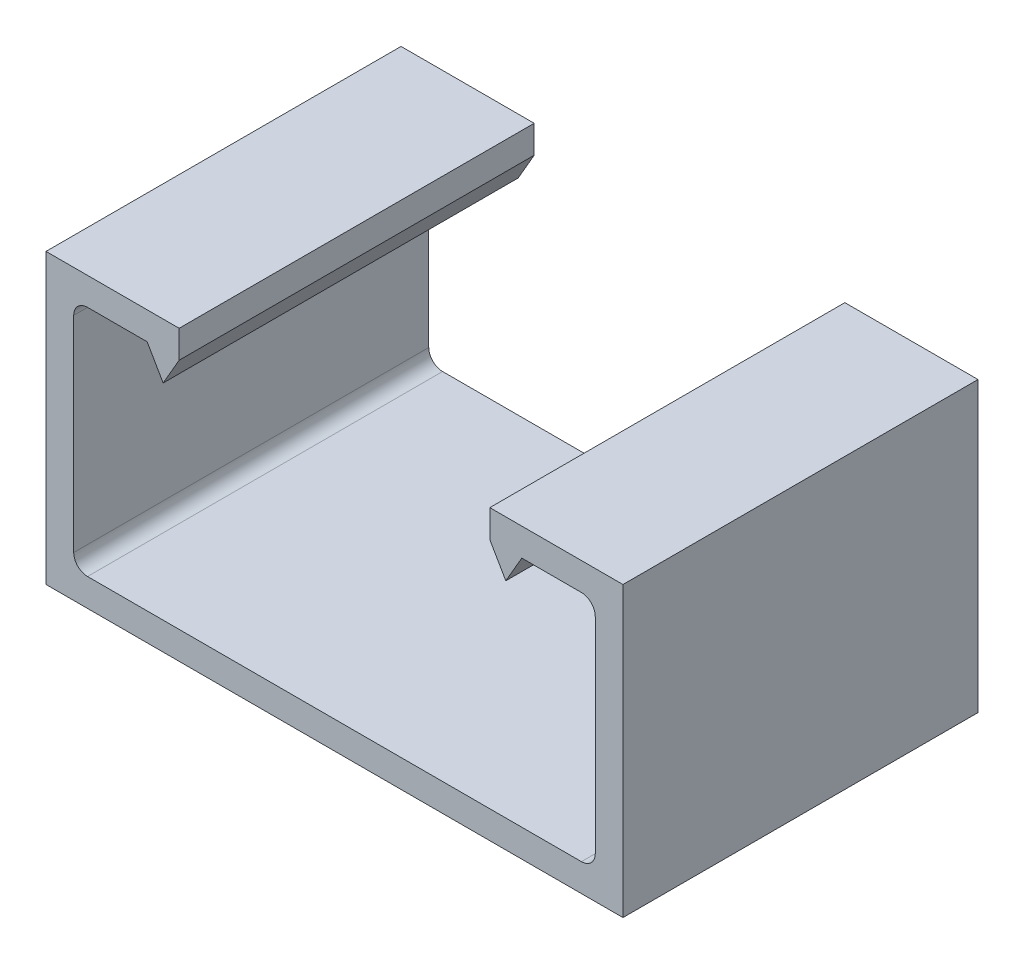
ISO-10303-21;
HEADER;
FILE_DESCRIPTION(('STEP AP214'),'2;1');
FILE_NAME('part.step','',(''),(''),'','','');
FILE_SCHEMA(('AUTOMOTIVE_DESIGN { 1 0 10303 214 1 1 1 1 }'));
ENDSEC;
DATA;
#1=APPLICATION_CONTEXT('core data for automotive mechanical design processes');
#2=APPLICATION_PROTOCOL_DEFINITION('international standard','automotive_design',2000,#1);
#3=PRODUCT_CONTEXT('',#1,'mechanical');
#4=PRODUCT('Part','Part','',(#3));
#5=PRODUCT_RELATED_PRODUCT_CATEGORY('part','',(#4));
#6=PRODUCT_DEFINITION_FORMATION('','',#4);
#7=PRODUCT_DEFINITION_CONTEXT('part definition',#1,'design');
#8=PRODUCT_DEFINITION('design','',#6,#7);
#9=PRODUCT_DEFINITION_SHAPE('','',#8);
#10=(LENGTH_UNIT() NAMED_UNIT(*) SI_UNIT(.MILLI.,.METRE.));
#11=(NAMED_UNIT(*) PLANE_ANGLE_UNIT() SI_UNIT($,.RADIAN.));
#12=(NAMED_UNIT(*) SI_UNIT($,.STERADIAN.) SOLID_ANGLE_UNIT());
#13=UNCERTAINTY_MEASURE_WITH_UNIT(LENGTH_MEASURE(1.E-05),#10,'distance_accuracy_value','');
#14=(GEOMETRIC_REPRESENTATION_CONTEXT(3) GLOBAL_UNCERTAINTY_ASSIGNED_CONTEXT((#13)) GLOBAL_UNIT_ASSIGNED_CONTEXT((#10,
#11,#12)) REPRESENTATION_CONTEXT('',''));
#15=CARTESIAN_POINT('',(0.,0.,0.));
#16=DIRECTION('',(0.,0.,1.));
#17=DIRECTION('',(1.,0.,0.));
#18=AXIS2_PLACEMENT_3D('',#15,#16,#17);
#19=CARTESIAN_POINT('',(-17.6657,-7.34695,12.7));
#20=DIRECTION('',(0.,0.,-1.));
#21=DIRECTION('',(-1.,0.,0.));
#22=AXIS2_PLACEMENT_3D('',#19,#20,#21);
#23=CYLINDRICAL_SURFACE('',#22,0.9906);
#24=CARTESIAN_POINT('',(-17.6657,-7.34695,-12.7));
#25=DIRECTION('',(0.,0.,-1.));
#26=DIRECTION('',(1.,0.,0.));
#27=AXIS2_PLACEMENT_3D('',#24,#25,#26);
#28=CIRCLE('',#27,0.9906);
#29=CARTESIAN_POINT('',(-17.6657,-8.33755,-12.7));
#30=VERTEX_POINT('',#29);
#31=CARTESIAN_POINT('',(-18.6563,-7.34695,-12.7));
#32=VERTEX_POINT('',#31);
#33=EDGE_CURVE('E200',#30,#32,#28,.T.);
#34=ORIENTED_EDGE('',*,*,#33,.T.);
#35=DIRECTION('',(0.,0.,-1.));
#36=VECTOR('',#35,1.);
#37=CARTESIAN_POINT('',(-18.6563,-7.34695,12.7));
#38=LINE('',#37,#36);
#39=CARTESIAN_POINT('',(-18.6563,-7.34695,12.7));
#40=VERTEX_POINT('',#39);
#41=EDGE_CURVE('E11',#40,#32,#38,.T.);
#42=ORIENTED_EDGE('',*,*,#41,.F.);
#43=CARTESIAN_POINT('',(-17.6657,-7.34695,12.7));
#44=DIRECTION('',(0.,0.,-1.));
#45=DIRECTION('',(1.,0.,0.));
#46=AXIS2_PLACEMENT_3D('',#43,#44,#45);
#47=CIRCLE('',#46,0.9906);
#48=CARTESIAN_POINT('',(-17.6657,-8.33755,12.7));
#49=VERTEX_POINT('',#48);
#50=EDGE_CURVE('E238',#49,#40,#47,.T.);
#51=ORIENTED_EDGE('',*,*,#50,.F.);
#52=DIRECTION('',(0.,0.,-1.));
#53=VECTOR('',#52,1.);
#54=CARTESIAN_POINT('',(-17.6657,-8.33755,12.7));
#55=LINE('',#54,#53);
#56=EDGE_CURVE('E196',#49,#30,#55,.T.);
#57=ORIENTED_EDGE('',*,*,#56,.T.);
#58=EDGE_LOOP('',(#34,#42,#51,#57));
#59=FACE_BOUND('',#58,.T.);
#60=ADVANCED_FACE('F32',(#59),#23,.F.);
#61=CARTESIAN_POINT('',(-18.6563,7.34695,12.7));
#62=DIRECTION('',(-1.,0.,0.));
#63=DIRECTION('',(0.,-1.,0.));
#64=AXIS2_PLACEMENT_3D('',#61,#62,#63);
#65=PLANE('',#64);
#66=DIRECTION('',(0.,1.,0.));
#67=VECTOR('',#66,1.);
#68=CARTESIAN_POINT('',(-18.6563,7.34695,-12.7));
#69=LINE('',#68,#67);
#70=CARTESIAN_POINT('',(-18.6563,7.34695,-12.7));
#71=VERTEX_POINT('',#70);
#72=EDGE_CURVE('E203',#32,#71,#69,.T.);
#73=ORIENTED_EDGE('',*,*,#72,.T.);
#74=DIRECTION('',(0.,0.,-1.));
#75=VECTOR('',#74,1.);
#76=CARTESIAN_POINT('',(-18.6563,7.34695,12.7));
#77=LINE('',#76,#75);
#78=CARTESIAN_POINT('',(-18.6563,7.34695,12.7));
#79=VERTEX_POINT('',#78);
#80=EDGE_CURVE('E40',#79,#71,#77,.T.);
#81=ORIENTED_EDGE('',*,*,#80,.F.);
#82=DIRECTION('',(0.,1.,0.));
#83=VECTOR('',#82,1.);
#84=CARTESIAN_POINT('',(-18.6563,7.34695,12.7));
#85=LINE('',#84,#83);
#86=EDGE_CURVE('E127',#40,#79,#85,.T.);
#87=ORIENTED_EDGE('',*,*,#86,.F.);
#88=ORIENTED_EDGE('',*,*,#41,.T.);
#89=EDGE_LOOP('',(#73,#81,#87,#88));
#90=FACE_BOUND('',#89,.T.);
#91=ADVANCED_FACE('F356',(#90),#65,.F.);
#92=CARTESIAN_POINT('',(-17.6657,7.34695,12.7));
#93=DIRECTION('',(0.,0.,-1.));
#94=DIRECTION('',(-1.,0.,0.));
#95=AXIS2_PLACEMENT_3D('',#92,#93,#94);
#96=CYLINDRICAL_SURFACE('',#95,0.990599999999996);
#97=CARTESIAN_POINT('',(-17.6657,7.34695,-12.7));
#98=DIRECTION('',(0.,0.,-1.));
#99=DIRECTION('',(1.,0.,0.));
#100=AXIS2_PLACEMENT_3D('',#97,#98,#99);
#101=CIRCLE('',#100,0.990599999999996);
#102=CARTESIAN_POINT('',(-17.6657,8.33754999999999,-12.7));
#103=VERTEX_POINT('',#102);
#104=EDGE_CURVE('E205',#71,#103,#101,.T.);
#105=ORIENTED_EDGE('',*,*,#104,.T.);
#106=DIRECTION('',(0.,0.,-1.));
#107=VECTOR('',#106,1.);
#108=CARTESIAN_POINT('',(-17.6657,8.33754999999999,12.7));
#109=LINE('',#108,#107);
#110=CARTESIAN_POINT('',(-17.6657,8.33754999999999,12.7));
#111=VERTEX_POINT('',#110);
#112=EDGE_CURVE('E281',#111,#103,#109,.T.);
#113=ORIENTED_EDGE('',*,*,#112,.F.);
#114=CARTESIAN_POINT('',(-17.6657,7.34695,12.7));
#115=DIRECTION('',(0.,0.,-1.));
#116=DIRECTION('',(1.,0.,0.));
#117=AXIS2_PLACEMENT_3D('',#114,#115,#116);
#118=CIRCLE('',#117,0.990599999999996);
#119=EDGE_CURVE('E289',#79,#111,#118,.T.);
#120=ORIENTED_EDGE('',*,*,#119,.F.);
#121=ORIENTED_EDGE('',*,*,#80,.T.);
#122=EDGE_LOOP('',(#105,#113,#120,#121));
#123=FACE_BOUND('',#122,.T.);
#124=ADVANCED_FACE('F287',(#123),#96,.F.);
#125=CARTESIAN_POINT('',(-13.400192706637,8.33755,12.7));
#126=DIRECTION('',(0.,1.,0.));
#127=DIRECTION('',(-1.,0.,0.));
#128=AXIS2_PLACEMENT_3D('',#125,#126,#127);
#129=PLANE('',#128);
#130=DIRECTION('',(1.,0.,0.));
#131=VECTOR('',#130,1.);
#132=CARTESIAN_POINT('',(-13.400192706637,8.33755,-12.7));
#133=LINE('',#132,#131);
#134=CARTESIAN_POINT('',(-13.400192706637,8.33755,-12.7));
#135=VERTEX_POINT('',#134);
#136=EDGE_CURVE('E207',#103,#135,#133,.T.);
#137=ORIENTED_EDGE('',*,*,#136,.T.);
#138=DIRECTION('',(0.,0.,-1.));
#139=VECTOR('',#138,1.);
#140=CARTESIAN_POINT('',(-13.400192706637,8.33755,12.7));
#141=LINE('',#140,#139);
#142=CARTESIAN_POINT('',(-13.400192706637,8.33755,12.7));
#143=VERTEX_POINT('',#142);
#144=EDGE_CURVE('E278',#143,#135,#141,.T.);
#145=ORIENTED_EDGE('',*,*,#144,.F.);
#146=DIRECTION('',(1.,0.,0.));
#147=VECTOR('',#146,1.);
#148=CARTESIAN_POINT('',(-13.400192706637,8.33755,12.7));
#149=LINE('',#148,#147);
#150=EDGE_CURVE('E307',#111,#143,#149,.T.);
#151=ORIENTED_EDGE('',*,*,#150,.F.);
#152=ORIENTED_EDGE('',*,*,#112,.T.);
#153=EDGE_LOOP('',(#137,#145,#151,#152));
#154=FACE_BOUND('',#153,.T.);
#155=ADVANCED_FACE('F298',(#154),#129,.F.);
#156=CARTESIAN_POINT('',(-13.400192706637,8.33755,12.7));
#157=DIRECTION('',(0.866025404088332,0.499999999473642,0.));
#158=DIRECTION('',(-0.499999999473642,0.866025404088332,0.));
#159=AXIS2_PLACEMENT_3D('',#156,#157,#158);
#160=PLANE('',#159);
#161=DIRECTION('',(0.499999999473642,-0.866025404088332,0.));
#162=VECTOR('',#161,1.);
#163=CARTESIAN_POINT('',(-13.400192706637,8.33755,-12.7));
#164=LINE('',#163,#162);
#165=CARTESIAN_POINT('',(-12.256346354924,6.35635,-12.7));
#166=VERTEX_POINT('',#165);
#167=EDGE_CURVE('E209',#135,#166,#164,.T.);
#168=ORIENTED_EDGE('',*,*,#167,.T.);
#169=DIRECTION('',(0.,0.,-1.));
#170=VECTOR('',#169,1.);
#171=CARTESIAN_POINT('',(-12.256346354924,6.35635,12.7));
#172=LINE('',#171,#170);
#173=CARTESIAN_POINT('',(-12.256346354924,6.35635,12.7));
#174=VERTEX_POINT('',#173);
#175=EDGE_CURVE('E275',#174,#166,#172,.T.);
#176=ORIENTED_EDGE('',*,*,#175,.F.);
#177=DIRECTION('',(0.499999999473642,-0.866025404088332,0.));
#178=VECTOR('',#177,1.);
#179=CARTESIAN_POINT('',(-13.400192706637,8.33755,12.7));
#180=LINE('',#179,#178);
#181=EDGE_CURVE('E304',#143,#174,#180,.T.);
#182=ORIENTED_EDGE('',*,*,#181,.F.);
#183=ORIENTED_EDGE('',*,*,#144,.T.);
#184=EDGE_LOOP('',(#168,#176,#182,#183));
#185=FACE_BOUND('',#184,.T.);
#186=ADVANCED_FACE('F302',(#185),#160,.F.);
#187=CARTESIAN_POINT('',(-12.256346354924,6.35635,12.7));
#188=DIRECTION('',(-0.866025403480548,0.500000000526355,0.));
#189=DIRECTION('',(-0.500000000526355,-0.866025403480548,0.));
#190=AXIS2_PLACEMENT_3D('',#187,#188,#189);
#191=PLANE('',#190);
#192=DIRECTION('',(0.500000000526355,0.866025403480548,0.));
#193=VECTOR('',#192,1.);
#194=CARTESIAN_POINT('',(-12.256346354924,6.35635,-12.7));
#195=LINE('',#194,#193);
#196=CARTESIAN_POINT('',(-11.1125,8.33755,-12.7));
#197=VERTEX_POINT('',#196);
#198=EDGE_CURVE('E211',#166,#197,#195,.T.);
#199=ORIENTED_EDGE('',*,*,#198,.T.);
#200=DIRECTION('',(0.,0.,-1.));
#201=VECTOR('',#200,1.);
#202=CARTESIAN_POINT('',(-11.1125,8.33755,12.7));
#203=LINE('',#202,#201);
#204=CARTESIAN_POINT('',(-11.1125,8.33755,12.7));
#205=VERTEX_POINT('',#204);
#206=EDGE_CURVE('E272',#205,#197,#203,.T.);
#207=ORIENTED_EDGE('',*,*,#206,.F.);
#208=DIRECTION('',(0.500000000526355,0.866025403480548,0.));
#209=VECTOR('',#208,1.);
#210=CARTESIAN_POINT('',(-12.256346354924,6.35635,12.7));
#211=LINE('',#210,#209);
#212=EDGE_CURVE('E306',#174,#205,#211,.T.);
#213=ORIENTED_EDGE('',*,*,#212,.F.);
#214=ORIENTED_EDGE('',*,*,#175,.T.);
#215=EDGE_LOOP('',(#199,#207,#213,#214));
#216=FACE_BOUND('',#215,.T.);
#217=ADVANCED_FACE('F369',(#216),#191,.F.);
#218=CARTESIAN_POINT('',(-11.1125,8.33755,12.7));
#219=DIRECTION('',(-1.,0.,0.));
#220=DIRECTION('',(0.,-1.,0.));
#221=AXIS2_PLACEMENT_3D('',#218,#219,#220);
#222=PLANE('',#221);
#223=DIRECTION('',(0.,1.,0.));
#224=VECTOR('',#223,1.);
#225=CARTESIAN_POINT('',(-11.1125,8.33755,-12.7));
#226=LINE('',#225,#224);
#227=CARTESIAN_POINT('',(-11.1125,10.31875,-12.7));
#228=VERTEX_POINT('',#227);
#229=EDGE_CURVE('E213',#197,#228,#226,.T.);
#230=ORIENTED_EDGE('',*,*,#229,.T.);
#231=DIRECTION('',(0.,0.,-1.));
#232=VECTOR('',#231,1.);
#233=CARTESIAN_POINT('',(-11.1125,10.31875,12.7));
#234=LINE('',#233,#232);
#235=CARTESIAN_POINT('',(-11.1125,10.31875,12.7));
#236=VERTEX_POINT('',#235);
#237=EDGE_CURVE('E269',#236,#228,#234,.T.);
#238=ORIENTED_EDGE('',*,*,#237,.F.);
#239=DIRECTION('',(0.,1.,0.));
#240=VECTOR('',#239,1.);
#241=CARTESIAN_POINT('',(-11.1125,8.33755,12.7));
#242=LINE('',#241,#240);
#243=EDGE_CURVE('E309',#205,#236,#242,.T.);
#244=ORIENTED_EDGE('',*,*,#243,.F.);
#245=ORIENTED_EDGE('',*,*,#206,.T.);
#246=EDGE_LOOP('',(#230,#238,#244,#245));
#247=FACE_BOUND('',#246,.T.);
#248=ADVANCED_FACE('F372',(#247),#222,.F.);
#249=CARTESIAN_POINT('',(-11.1125,10.31875,12.7));
#250=DIRECTION('',(0.,-1.,0.));
#251=DIRECTION('',(1.,0.,0.));
#252=AXIS2_PLACEMENT_3D('',#249,#250,#251);
#253=PLANE('',#252);
#254=DIRECTION('',(-1.,0.,0.));
#255=VECTOR('',#254,1.);
#256=CARTESIAN_POINT('',(-11.1125,10.31875,-12.7));
#257=LINE('',#256,#255);
#258=CARTESIAN_POINT('',(-20.6375,10.31875,-12.7));
#259=VERTEX_POINT('',#258);
#260=EDGE_CURVE('E215',#228,#259,#257,.T.);
#261=ORIENTED_EDGE('',*,*,#260,.T.);
#262=DIRECTION('',(0.,0.,-1.));
#263=VECTOR('',#262,1.);
#264=CARTESIAN_POINT('',(-20.6375,10.31875,12.7));
#265=LINE('',#264,#263);
#266=CARTESIAN_POINT('',(-20.6375,10.31875,12.7));
#267=VERTEX_POINT('',#266);
#268=EDGE_CURVE('E266',#267,#259,#265,.T.);
#269=ORIENTED_EDGE('',*,*,#268,.F.);
#270=DIRECTION('',(-1.,0.,0.));
#271=VECTOR('',#270,1.);
#272=CARTESIAN_POINT('',(-11.1125,10.31875,12.7));
#273=LINE('',#272,#271);
#274=EDGE_CURVE('E315',#236,#267,#273,.T.);
#275=ORIENTED_EDGE('',*,*,#274,.F.);
#276=ORIENTED_EDGE('',*,*,#237,.T.);
#277=EDGE_LOOP('',(#261,#269,#275,#276));
#278=FACE_BOUND('',#277,.T.);
#279=ADVANCED_FACE('F376',(#278),#253,.F.);
#280=CARTESIAN_POINT('',(-20.6375,10.31875,12.7));
#281=DIRECTION('',(1.,0.,0.));
#282=DIRECTION('',(0.,1.,0.));
#283=AXIS2_PLACEMENT_3D('',#280,#281,#282);
#284=PLANE('',#283);
#285=DIRECTION('',(0.,-1.,0.));
#286=VECTOR('',#285,1.);
#287=CARTESIAN_POINT('',(-20.6375,10.31875,-12.7));
#288=LINE('',#287,#286);
#289=CARTESIAN_POINT('',(-20.6375,-10.31875,-12.7));
#290=VERTEX_POINT('',#289);
#291=EDGE_CURVE('E217',#259,#290,#288,.T.);
#292=ORIENTED_EDGE('',*,*,#291,.T.);
#293=DIRECTION('',(0.,0.,-1.));
#294=VECTOR('',#293,1.);
#295=CARTESIAN_POINT('',(-20.6375,-10.31875,12.7));
#296=LINE('',#295,#294);
#297=CARTESIAN_POINT('',(-20.6375,-10.31875,12.7));
#298=VERTEX_POINT('',#297);
#299=EDGE_CURVE('E263',#298,#290,#296,.T.);
#300=ORIENTED_EDGE('',*,*,#299,.F.);
#301=DIRECTION('',(0.,-1.,0.));
#302=VECTOR('',#301,1.);
#303=CARTESIAN_POINT('',(-20.6375,10.31875,12.7));
#304=LINE('',#303,#302);
#305=EDGE_CURVE('E317',#267,#298,#304,.T.);
#306=ORIENTED_EDGE('',*,*,#305,.F.);
#307=ORIENTED_EDGE('',*,*,#268,.T.);
#308=EDGE_LOOP('',(#292,#300,#306,#307));
#309=FACE_BOUND('',#308,.T.);
#310=ADVANCED_FACE('F380',(#309),#284,.F.);
#311=CARTESIAN_POINT('',(-20.6375,-10.31875,12.7));
#312=DIRECTION('',(0.,1.,0.));
#313=DIRECTION('',(0.,0.,1.));
#314=AXIS2_PLACEMENT_3D('',#311,#312,#313);
#315=PLANE('',#314);
#316=DIRECTION('',(1.,0.,0.));
#317=VECTOR('',#316,1.);
#318=CARTESIAN_POINT('',(-20.6375,-10.31875,-12.7));
#319=LINE('',#318,#317);
#320=CARTESIAN_POINT('',(20.6375,-10.31875,-12.7));
#321=VERTEX_POINT('',#320);
#322=EDGE_CURVE('E219',#290,#321,#319,.T.);
#323=ORIENTED_EDGE('',*,*,#322,.T.);
#324=DIRECTION('',(0.,0.,-1.));
#325=VECTOR('',#324,1.);
#326=CARTESIAN_POINT('',(20.6375,-10.31875,12.7));
#327=LINE('',#326,#325);
#328=CARTESIAN_POINT('',(20.6375,-10.31875,12.7));
#329=VERTEX_POINT('',#328);
#330=EDGE_CURVE('E260',#329,#321,#327,.T.);
#331=ORIENTED_EDGE('',*,*,#330,.F.);
#332=DIRECTION('',(1.,0.,0.));
#333=VECTOR('',#332,1.);
#334=CARTESIAN_POINT('',(-20.6375,-10.31875,12.7));
#335=LINE('',#334,#333);
#336=EDGE_CURVE('E319',#298,#329,#335,.T.);
#337=ORIENTED_EDGE('',*,*,#336,.F.);
#338=ORIENTED_EDGE('',*,*,#299,.T.);
#339=EDGE_LOOP('',(#323,#331,#337,#338));
#340=FACE_BOUND('',#339,.T.);
#341=ADVANCED_FACE('F384',(#340),#315,.F.);
#342=CARTESIAN_POINT('',(20.6375,-10.31875,12.7));
#343=DIRECTION('',(-1.,0.,0.));
#344=DIRECTION('',(0.,0.,1.));
#345=AXIS2_PLACEMENT_3D('',#342,#343,#344);
#346=PLANE('',#345);
#347=DIRECTION('',(0.,1.,0.));
#348=VECTOR('',#347,1.);
#349=CARTESIAN_POINT('',(20.6375,-10.31875,-12.7));
#350=LINE('',#349,#348);
#351=CARTESIAN_POINT('',(20.6375,10.31875,-12.7));
#352=VERTEX_POINT('',#351);
#353=EDGE_CURVE('E221',#321,#352,#350,.T.);
#354=ORIENTED_EDGE('',*,*,#353,.T.);
#355=DIRECTION('',(0.,0.,-1.));
#356=VECTOR('',#355,1.);
#357=CARTESIAN_POINT('',(20.6375,10.31875,12.7));
#358=LINE('',#357,#356);
#359=CARTESIAN_POINT('',(20.6375,10.31875,12.7));
#360=VERTEX_POINT('',#359);
#361=EDGE_CURVE('E257',#360,#352,#358,.T.);
#362=ORIENTED_EDGE('',*,*,#361,.F.);
#363=DIRECTION('',(0.,1.,0.));
#364=VECTOR('',#363,1.);
#365=CARTESIAN_POINT('',(20.6375,-10.31875,12.7));
#366=LINE('',#365,#364);
#367=EDGE_CURVE('E321',#329,#360,#366,.T.);
#368=ORIENTED_EDGE('',*,*,#367,.F.);
#369=ORIENTED_EDGE('',*,*,#330,.T.);
#370=EDGE_LOOP('',(#354,#362,#368,#369));
#371=FACE_BOUND('',#370,.T.);
#372=ADVANCED_FACE('F388',(#371),#346,.F.);
#373=CARTESIAN_POINT('',(20.6375,10.31875,12.7));
#374=DIRECTION('',(0.,-1.,0.));
#375=DIRECTION('',(0.,0.,-1.));
#376=AXIS2_PLACEMENT_3D('',#373,#374,#375);
#377=PLANE('',#376);
#378=DIRECTION('',(-1.,0.,0.));
#379=VECTOR('',#378,1.);
#380=CARTESIAN_POINT('',(20.6375,10.31875,-12.7));
#381=LINE('',#380,#379);
#382=CARTESIAN_POINT('',(11.1125,10.31875,-12.7));
#383=VERTEX_POINT('',#382);
#384=EDGE_CURVE('E223',#352,#383,#381,.T.);
#385=ORIENTED_EDGE('',*,*,#384,.T.);
#386=DIRECTION('',(0.,0.,-1.));
#387=VECTOR('',#386,1.);
#388=CARTESIAN_POINT('',(11.1125,10.31875,12.7));
#389=LINE('',#388,#387);
#390=CARTESIAN_POINT('',(11.1125,10.31875,12.7));
#391=VERTEX_POINT('',#390);
#392=EDGE_CURVE('E254',#391,#383,#389,.T.);
#393=ORIENTED_EDGE('',*,*,#392,.F.);
#394=DIRECTION('',(-1.,0.,0.));
#395=VECTOR('',#394,1.);
#396=CARTESIAN_POINT('',(20.6375,10.31875,12.7));
#397=LINE('',#396,#395);
#398=EDGE_CURVE('E323',#360,#391,#397,.T.);
#399=ORIENTED_EDGE('',*,*,#398,.F.);
#400=ORIENTED_EDGE('',*,*,#361,.T.);
#401=EDGE_LOOP('',(#385,#393,#399,#400));
#402=FACE_BOUND('',#401,.T.);
#403=ADVANCED_FACE('F392',(#402),#377,.F.);
#404=CARTESIAN_POINT('',(11.1125,8.33755,12.7));
#405=DIRECTION('',(1.,0.,0.));
#406=DIRECTION('',(0.,1.,0.));
#407=AXIS2_PLACEMENT_3D('',#404,#405,#406);
#408=PLANE('',#407);
#409=DIRECTION('',(0.,-1.,0.));
#410=VECTOR('',#409,1.);
#411=CARTESIAN_POINT('',(11.1125,8.33755,-12.7));
#412=LINE('',#411,#410);
#413=CARTESIAN_POINT('',(11.1125,8.33755,-12.7));
#414=VERTEX_POINT('',#413);
#415=EDGE_CURVE('E225',#383,#414,#412,.T.);
#416=ORIENTED_EDGE('',*,*,#415,.T.);
#417=DIRECTION('',(0.,0.,-1.));
#418=VECTOR('',#417,1.);
#419=CARTESIAN_POINT('',(11.1125,8.33755,12.7));
#420=LINE('',#419,#418);
#421=CARTESIAN_POINT('',(11.1125,8.33755,12.7));
#422=VERTEX_POINT('',#421);
#423=EDGE_CURVE('E251',#422,#414,#420,.T.);
#424=ORIENTED_EDGE('',*,*,#423,.F.);
#425=DIRECTION('',(0.,-1.,0.));
#426=VECTOR('',#425,1.);
#427=CARTESIAN_POINT('',(11.1125,8.33755,12.7));
#428=LINE('',#427,#426);
#429=EDGE_CURVE('E325',#391,#422,#428,.T.);
#430=ORIENTED_EDGE('',*,*,#429,.F.);
#431=ORIENTED_EDGE('',*,*,#392,.T.);
#432=EDGE_LOOP('',(#416,#424,#430,#431));
#433=FACE_BOUND('',#432,.T.);
#434=ADVANCED_FACE('F396',(#433),#408,.F.);
#435=CARTESIAN_POINT('',(12.256346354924,6.35635,12.7));
#436=DIRECTION('',(0.866025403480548,0.500000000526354,0.));
#437=DIRECTION('',(-0.500000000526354,0.866025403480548,0.));
#438=AXIS2_PLACEMENT_3D('',#435,#436,#437);
#439=PLANE('',#438);
#440=DIRECTION('',(0.500000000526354,-0.866025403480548,0.));
#441=VECTOR('',#440,1.);
#442=CARTESIAN_POINT('',(12.256346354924,6.35635,-12.7));
#443=LINE('',#442,#441);
#444=CARTESIAN_POINT('',(12.256346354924,6.35635,-12.7));
#445=VERTEX_POINT('',#444);
#446=EDGE_CURVE('E227',#414,#445,#443,.T.);
#447=ORIENTED_EDGE('',*,*,#446,.T.);
#448=DIRECTION('',(0.,0.,-1.));
#449=VECTOR('',#448,1.);
#450=CARTESIAN_POINT('',(12.256346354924,6.35635,12.7));
#451=LINE('',#450,#449);
#452=CARTESIAN_POINT('',(12.256346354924,6.35635,12.7));
#453=VERTEX_POINT('',#452);
#454=EDGE_CURVE('E248',#453,#445,#451,.T.);
#455=ORIENTED_EDGE('',*,*,#454,.F.);
#456=DIRECTION('',(0.500000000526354,-0.866025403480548,0.));
#457=VECTOR('',#456,1.);
#458=CARTESIAN_POINT('',(12.256346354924,6.35635,12.7));
#459=LINE('',#458,#457);
#460=EDGE_CURVE('E327',#422,#453,#459,.T.);
#461=ORIENTED_EDGE('',*,*,#460,.F.);
#462=ORIENTED_EDGE('',*,*,#423,.T.);
#463=EDGE_LOOP('',(#447,#455,#461,#462));
#464=FACE_BOUND('',#463,.T.);
#465=ADVANCED_FACE('F400',(#464),#439,.F.);
#466=CARTESIAN_POINT('',(13.400192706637,8.33755,12.7));
#467=DIRECTION('',(-0.866025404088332,0.499999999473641,0.));
#468=DIRECTION('',(-0.499999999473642,-0.866025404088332,0.));
#469=AXIS2_PLACEMENT_3D('',#466,#467,#468);
#470=PLANE('',#469);
#471=DIRECTION('',(0.499999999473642,0.866025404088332,0.));
#472=VECTOR('',#471,1.);
#473=CARTESIAN_POINT('',(13.400192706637,8.33755,-12.7));
#474=LINE('',#473,#472);
#475=CARTESIAN_POINT('',(13.400192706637,8.33755,-12.7));
#476=VERTEX_POINT('',#475);
#477=EDGE_CURVE('E229',#445,#476,#474,.T.);
#478=ORIENTED_EDGE('',*,*,#477,.T.);
#479=DIRECTION('',(0.,0.,-1.));
#480=VECTOR('',#479,1.);
#481=CARTESIAN_POINT('',(13.400192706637,8.33755,12.7));
#482=LINE('',#481,#480);
#483=CARTESIAN_POINT('',(13.400192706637,8.33755,12.7));
#484=VERTEX_POINT('',#483);
#485=EDGE_CURVE('E245',#484,#476,#482,.T.);
#486=ORIENTED_EDGE('',*,*,#485,.F.);
#487=DIRECTION('',(0.499999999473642,0.866025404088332,0.));
#488=VECTOR('',#487,1.);
#489=CARTESIAN_POINT('',(13.400192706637,8.33755,12.7));
#490=LINE('',#489,#488);
#491=EDGE_CURVE('E329',#453,#484,#490,.T.);
#492=ORIENTED_EDGE('',*,*,#491,.F.);
#493=ORIENTED_EDGE('',*,*,#454,.T.);
#494=EDGE_LOOP('',(#478,#486,#492,#493));
#495=FACE_BOUND('',#494,.T.);
#496=ADVANCED_FACE('F404',(#495),#470,.F.);
#497=CARTESIAN_POINT('',(17.6657,8.33755,12.7));
#498=DIRECTION('',(0.,1.,0.));
#499=DIRECTION('',(-1.,0.,0.));
#500=AXIS2_PLACEMENT_3D('',#497,#498,#499);
#501=PLANE('',#500);
#502=DIRECTION('',(1.,0.,0.));
#503=VECTOR('',#502,1.);
#504=CARTESIAN_POINT('',(17.6657,8.33755,-12.7));
#505=LINE('',#504,#503);
#506=CARTESIAN_POINT('',(17.6657,8.33755,-12.7));
#507=VERTEX_POINT('',#506);
#508=EDGE_CURVE('E231',#476,#507,#505,.T.);
#509=ORIENTED_EDGE('',*,*,#508,.T.);
#510=DIRECTION('',(0.,0.,-1.));
#511=VECTOR('',#510,1.);
#512=CARTESIAN_POINT('',(17.6657,8.33755,12.7));
#513=LINE('',#512,#511);
#514=CARTESIAN_POINT('',(17.6657,8.33755,12.7));
#515=VERTEX_POINT('',#514);
#516=EDGE_CURVE('E242',#515,#507,#513,.T.);
#517=ORIENTED_EDGE('',*,*,#516,.F.);
#518=DIRECTION('',(1.,0.,0.));
#519=VECTOR('',#518,1.);
#520=CARTESIAN_POINT('',(17.6657,8.33755,12.7));
#521=LINE('',#520,#519);
#522=EDGE_CURVE('E331',#484,#515,#521,.T.);
#523=ORIENTED_EDGE('',*,*,#522,.F.);
#524=ORIENTED_EDGE('',*,*,#485,.T.);
#525=EDGE_LOOP('',(#509,#517,#523,#524));
#526=FACE_BOUND('',#525,.T.);
#527=ADVANCED_FACE('F337',(#526),#501,.F.);
#528=CARTESIAN_POINT('',(17.6657,7.34695,12.7));
#529=DIRECTION('',(0.,0.,-1.));
#530=DIRECTION('',(-1.,0.,0.));
#531=AXIS2_PLACEMENT_3D('',#528,#529,#530);
#532=CYLINDRICAL_SURFACE('',#531,0.990599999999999);
#533=CARTESIAN_POINT('',(17.6657,7.34695,-12.7));
#534=DIRECTION('',(0.,0.,-1.));
#535=DIRECTION('',(1.,0.,0.));
#536=AXIS2_PLACEMENT_3D('',#533,#534,#535);
#537=CIRCLE('',#536,0.990599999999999);
#538=CARTESIAN_POINT('',(18.6563,7.34695,-12.7));
#539=VERTEX_POINT('',#538);
#540=EDGE_CURVE('E233',#507,#539,#537,.T.);
#541=ORIENTED_EDGE('',*,*,#540,.T.);
#542=DIRECTION('',(0.,0.,-1.));
#543=VECTOR('',#542,1.);
#544=CARTESIAN_POINT('',(18.6563,7.34695,12.7));
#545=LINE('',#544,#543);
#546=CARTESIAN_POINT('',(18.6563,7.34695,12.7));
#547=VERTEX_POINT('',#546);
#548=EDGE_CURVE('E191',#547,#539,#545,.T.);
#549=ORIENTED_EDGE('',*,*,#548,.F.);
#550=CARTESIAN_POINT('',(17.6657,7.34695,12.7));
#551=DIRECTION('',(0.,0.,-1.));
#552=DIRECTION('',(1.,0.,0.));
#553=AXIS2_PLACEMENT_3D('',#550,#551,#552);
#554=CIRCLE('',#553,0.990599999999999);
#555=EDGE_CURVE('E182',#515,#547,#554,.T.);
#556=ORIENTED_EDGE('',*,*,#555,.F.);
#557=ORIENTED_EDGE('',*,*,#516,.T.);
#558=EDGE_LOOP('',(#541,#549,#556,#557));
#559=FACE_BOUND('',#558,.T.);
#560=ADVANCED_FACE('F341',(#559),#532,.F.);
#561=CARTESIAN_POINT('',(18.6563,-7.34695,12.7));
#562=DIRECTION('',(1.,0.,0.));
#563=DIRECTION('',(0.,1.,0.));
#564=AXIS2_PLACEMENT_3D('',#561,#562,#563);
#565=PLANE('',#564);
#566=DIRECTION('',(0.,-1.,0.));
#567=VECTOR('',#566,1.);
#568=CARTESIAN_POINT('',(18.6563,-7.34695,-12.7));
#569=LINE('',#568,#567);
#570=CARTESIAN_POINT('',(18.6563,-7.34695,-12.7));
#571=VERTEX_POINT('',#570);
#572=EDGE_CURVE('E190',#539,#571,#569,.T.);
#573=ORIENTED_EDGE('',*,*,#572,.T.);
#574=DIRECTION('',(0.,0.,-1.));
#575=VECTOR('',#574,1.);
#576=CARTESIAN_POINT('',(18.6563,-7.34695,12.7));
#577=LINE('',#576,#575);
#578=CARTESIAN_POINT('',(18.6563,-7.34695,12.7));
#579=VERTEX_POINT('',#578);
#580=EDGE_CURVE('E187',#579,#571,#577,.T.);
#581=ORIENTED_EDGE('',*,*,#580,.F.);
#582=DIRECTION('',(0.,-1.,0.));
#583=VECTOR('',#582,1.);
#584=CARTESIAN_POINT('',(18.6563,-7.34695,12.7));
#585=LINE('',#584,#583);
#586=EDGE_CURVE('E176',#547,#579,#585,.T.);
#587=ORIENTED_EDGE('',*,*,#586,.F.);
#588=ORIENTED_EDGE('',*,*,#548,.T.);
#589=EDGE_LOOP('',(#573,#581,#587,#588));
#590=FACE_BOUND('',#589,.T.);
#591=ADVANCED_FACE('F188',(#590),#565,.F.);
#592=CARTESIAN_POINT('',(17.6657,-7.34695,12.7));
#593=DIRECTION('',(0.,0.,-1.));
#594=DIRECTION('',(-1.,0.,0.));
#595=AXIS2_PLACEMENT_3D('',#592,#593,#594);
#596=CYLINDRICAL_SURFACE('',#595,0.990599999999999);
#597=CARTESIAN_POINT('',(17.6657,-7.34695,-12.7));
#598=DIRECTION('',(0.,0.,-1.));
#599=DIRECTION('',(1.,0.,0.));
#600=AXIS2_PLACEMENT_3D('',#597,#598,#599);
#601=CIRCLE('',#600,0.990599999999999);
#602=CARTESIAN_POINT('',(17.6657,-8.33755,-12.7));
#603=VERTEX_POINT('',#602);
#604=EDGE_CURVE('E113',#571,#603,#601,.T.);
#605=ORIENTED_EDGE('',*,*,#604,.T.);
#606=DIRECTION('',(0.,0.,-1.));
#607=VECTOR('',#606,1.);
#608=CARTESIAN_POINT('',(17.6657,-8.33755,12.7));
#609=LINE('',#608,#607);
#610=CARTESIAN_POINT('',(17.6657,-8.33755,12.7));
#611=VERTEX_POINT('',#610);
#612=EDGE_CURVE('E192',#611,#603,#609,.T.);
#613=ORIENTED_EDGE('',*,*,#612,.F.);
#614=CARTESIAN_POINT('',(17.6657,-7.34695,12.7));
#615=DIRECTION('',(0.,0.,-1.));
#616=DIRECTION('',(1.,0.,0.));
#617=AXIS2_PLACEMENT_3D('',#614,#615,#616);
#618=CIRCLE('',#617,0.990599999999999);
#619=EDGE_CURVE('E180',#579,#611,#618,.T.);
#620=ORIENTED_EDGE('',*,*,#619,.F.);
#621=ORIENTED_EDGE('',*,*,#580,.T.);
#622=EDGE_LOOP('',(#605,#613,#620,#621));
#623=FACE_BOUND('',#622,.T.);
#624=ADVANCED_FACE('F194',(#623),#596,.F.);
#625=CARTESIAN_POINT('',(-17.6657,-8.33755,12.7));
#626=DIRECTION('',(0.,-1.,0.));
#627=DIRECTION('',(0.,0.,-1.));
#628=AXIS2_PLACEMENT_3D('',#625,#626,#627);
#629=PLANE('',#628);
#630=DIRECTION('',(-1.,0.,0.));
#631=VECTOR('',#630,1.);
#632=CARTESIAN_POINT('',(-17.6657,-8.33755,-12.7));
#633=LINE('',#632,#631);
#634=EDGE_CURVE('E119',#603,#30,#633,.T.);
#635=ORIENTED_EDGE('',*,*,#634,.T.);
#636=ORIENTED_EDGE('',*,*,#56,.F.);
#637=DIRECTION('',(-1.,0.,0.));
#638=VECTOR('',#637,1.);
#639=CARTESIAN_POINT('',(-17.6657,-8.33755,12.7));
#640=LINE('',#639,#638);
#641=EDGE_CURVE('E48',#611,#49,#640,.T.);
#642=ORIENTED_EDGE('',*,*,#641,.F.);
#643=ORIENTED_EDGE('',*,*,#612,.T.);
#644=EDGE_LOOP('',(#635,#636,#642,#643));
#645=FACE_BOUND('',#644,.T.);
#646=ADVANCED_FACE('F345',(#645),#629,.F.);
#647=CARTESIAN_POINT('',(-17.6657,-7.34695,12.7));
#648=DIRECTION('',(0.,0.,1.));
#649=DIRECTION('',(1.,0.,0.));
#650=AXIS2_PLACEMENT_3D('',#647,#648,#649);
#651=PLANE('',#650);
#652=ORIENTED_EDGE('',*,*,#50,.T.);
#653=ORIENTED_EDGE('',*,*,#86,.T.);
#654=ORIENTED_EDGE('',*,*,#119,.T.);
#655=ORIENTED_EDGE('',*,*,#150,.T.);
#656=ORIENTED_EDGE('',*,*,#181,.T.);
#657=ORIENTED_EDGE('',*,*,#212,.T.);
#658=ORIENTED_EDGE('',*,*,#243,.T.);
#659=ORIENTED_EDGE('',*,*,#274,.T.);
#660=ORIENTED_EDGE('',*,*,#305,.T.);
#661=ORIENTED_EDGE('',*,*,#336,.T.);
#662=ORIENTED_EDGE('',*,*,#367,.T.);
#663=ORIENTED_EDGE('',*,*,#398,.T.);
#664=ORIENTED_EDGE('',*,*,#429,.T.);
#665=ORIENTED_EDGE('',*,*,#460,.T.);
#666=ORIENTED_EDGE('',*,*,#491,.T.);
#667=ORIENTED_EDGE('',*,*,#522,.T.);
#668=ORIENTED_EDGE('',*,*,#555,.T.);
#669=ORIENTED_EDGE('',*,*,#586,.T.);
#670=ORIENTED_EDGE('',*,*,#619,.T.);
#671=ORIENTED_EDGE('',*,*,#641,.T.);
#672=EDGE_LOOP('',(#652,#653,#654,#655,#656,#657,#658,#659,#660,#661,#662,#663,#664,#665,#666,
#667,#668,#669,#670,#671));
#673=FACE_BOUND('',#672,.T.);
#674=ADVANCED_FACE('F178',(#673),#651,.T.);
#675=CARTESIAN_POINT('',(-17.6657,-7.34695,-12.7));
#676=DIRECTION('',(0.,0.,1.));
#677=DIRECTION('',(1.,0.,0.));
#678=AXIS2_PLACEMENT_3D('',#675,#676,#677);
#679=PLANE('',#678);
#680=ORIENTED_EDGE('',*,*,#33,.F.);
#681=ORIENTED_EDGE('',*,*,#634,.F.);
#682=ORIENTED_EDGE('',*,*,#604,.F.);
#683=ORIENTED_EDGE('',*,*,#572,.F.);
#684=ORIENTED_EDGE('',*,*,#540,.F.);
#685=ORIENTED_EDGE('',*,*,#508,.F.);
#686=ORIENTED_EDGE('',*,*,#477,.F.);
#687=ORIENTED_EDGE('',*,*,#446,.F.);
#688=ORIENTED_EDGE('',*,*,#415,.F.);
#689=ORIENTED_EDGE('',*,*,#384,.F.);
#690=ORIENTED_EDGE('',*,*,#353,.F.);
#691=ORIENTED_EDGE('',*,*,#322,.F.);
#692=ORIENTED_EDGE('',*,*,#291,.F.);
#693=ORIENTED_EDGE('',*,*,#260,.F.);
#694=ORIENTED_EDGE('',*,*,#229,.F.);
#695=ORIENTED_EDGE('',*,*,#198,.F.);
#696=ORIENTED_EDGE('',*,*,#167,.F.);
#697=ORIENTED_EDGE('',*,*,#136,.F.);
#698=ORIENTED_EDGE('',*,*,#104,.F.);
#699=ORIENTED_EDGE('',*,*,#72,.F.);
#700=EDGE_LOOP('',(#680,#681,#682,#683,#684,#685,#686,#687,#688,#689,#690,#691,#692,#693,#694,
#695,#696,#697,#698,#699));
#701=FACE_BOUND('',#700,.T.);
#702=ADVANCED_FACE('F293',(#701),#679,.F.);
#703=CLOSED_SHELL('',(#60,#91,#124,#155,#186,#217,#248,#279,#310,#341,#372,#403,#434,#465,#496,
#527,#560,#591,#624,#646,#674,#702));
#704=MANIFOLD_SOLID_BREP('B2',#703);
#705=ADVANCED_BREP_SHAPE_REPRESENTATION('',(#18,#704),#14);
#706=SHAPE_DEFINITION_REPRESENTATION(#9,#705);
ENDSEC;
END-ISO-10303-21;
